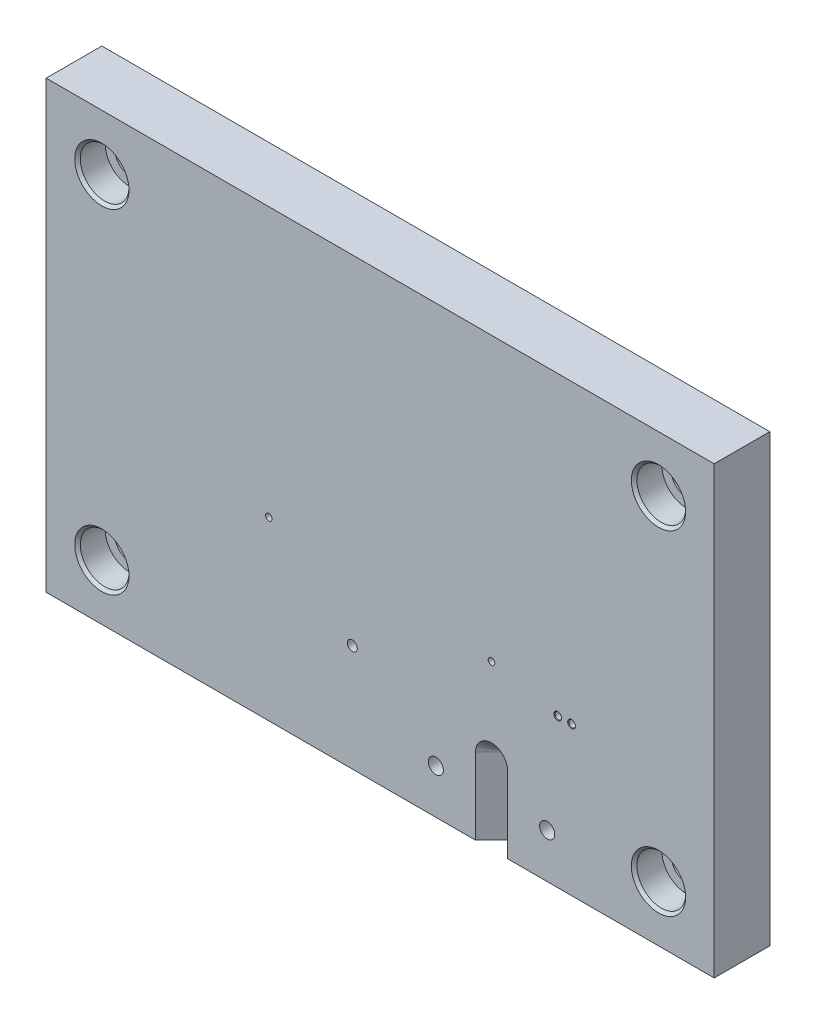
ISO-10303-21;
HEADER;
FILE_DESCRIPTION(('STEP AP214'),'2;1');
FILE_NAME('part.step','',(''),(''),'','','');
FILE_SCHEMA(('AUTOMOTIVE_DESIGN { 1 0 10303 214 1 1 1 1 }'));
ENDSEC;
DATA;
#1=APPLICATION_CONTEXT('core data for automotive mechanical design processes');
#2=APPLICATION_PROTOCOL_DEFINITION('international standard','automotive_design',2000,#1);
#3=PRODUCT_CONTEXT('',#1,'mechanical');
#4=PRODUCT('Part','Part','',(#3));
#5=PRODUCT_RELATED_PRODUCT_CATEGORY('part','',(#4));
#6=PRODUCT_DEFINITION_FORMATION('','',#4);
#7=PRODUCT_DEFINITION_CONTEXT('part definition',#1,'design');
#8=PRODUCT_DEFINITION('design','',#6,#7);
#9=PRODUCT_DEFINITION_SHAPE('','',#8);
#10=(LENGTH_UNIT() NAMED_UNIT(*) SI_UNIT(.MILLI.,.METRE.));
#11=(NAMED_UNIT(*) PLANE_ANGLE_UNIT() SI_UNIT($,.RADIAN.));
#12=(NAMED_UNIT(*) SI_UNIT($,.STERADIAN.) SOLID_ANGLE_UNIT());
#13=UNCERTAINTY_MEASURE_WITH_UNIT(LENGTH_MEASURE(1.E-05),#10,'distance_accuracy_value','');
#14=(GEOMETRIC_REPRESENTATION_CONTEXT(3) GLOBAL_UNCERTAINTY_ASSIGNED_CONTEXT((#13)) GLOBAL_UNIT_ASSIGNED_CONTEXT((#10,
#11,#12)) REPRESENTATION_CONTEXT('',''));
#15=CARTESIAN_POINT('',(0.,0.,0.));
#16=DIRECTION('',(0.,0.,1.));
#17=DIRECTION('',(1.,0.,0.));
#18=AXIS2_PLACEMENT_3D('',#15,#16,#17);
#19=CARTESIAN_POINT('',(152.4,101.6,12.7));
#20=DIRECTION('',(-1.,0.,0.));
#21=DIRECTION('',(0.,-1.,0.));
#22=AXIS2_PLACEMENT_3D('',#19,#20,#21);
#23=PLANE('',#22);
#24=DIRECTION('',(0.,1.,0.));
#25=VECTOR('',#24,1.);
#26=CARTESIAN_POINT('',(152.4,101.6,0.));
#27=LINE('',#26,#25);
#28=CARTESIAN_POINT('',(152.4,0.,0.));
#29=VERTEX_POINT('',#28);
#30=CARTESIAN_POINT('',(152.4,101.6,0.));
#31=VERTEX_POINT('',#30);
#32=EDGE_CURVE('E220',#29,#31,#27,.T.);
#33=ORIENTED_EDGE('',*,*,#32,.T.);
#34=DIRECTION('',(0.,0.,-1.));
#35=VECTOR('',#34,1.);
#36=CARTESIAN_POINT('',(152.4,101.6,12.7));
#37=LINE('',#36,#35);
#38=CARTESIAN_POINT('',(152.4,101.6,12.7));
#39=VERTEX_POINT('',#38);
#40=EDGE_CURVE('E249',#39,#31,#37,.T.);
#41=ORIENTED_EDGE('',*,*,#40,.F.);
#42=DIRECTION('',(0.,1.,0.));
#43=VECTOR('',#42,1.);
#44=CARTESIAN_POINT('',(152.4,101.6,12.7));
#45=LINE('',#44,#43);
#46=CARTESIAN_POINT('',(152.4,0.,12.7));
#47=VERTEX_POINT('',#46);
#48=EDGE_CURVE('E221',#47,#39,#45,.T.);
#49=ORIENTED_EDGE('',*,*,#48,.F.);
#50=DIRECTION('',(0.,0.,-1.));
#51=VECTOR('',#50,1.);
#52=CARTESIAN_POINT('',(152.4,0.,12.7));
#53=LINE('',#52,#51);
#54=EDGE_CURVE('E233',#47,#29,#53,.T.);
#55=ORIENTED_EDGE('',*,*,#54,.T.);
#56=EDGE_LOOP('',(#33,#41,#49,#55));
#57=FACE_BOUND('',#56,.T.);
#58=ADVANCED_FACE('F31',(#57),#23,.F.);
#59=CARTESIAN_POINT('',(0.,101.6,12.7));
#60=DIRECTION('',(0.,-1.,0.));
#61=DIRECTION('',(0.,0.,-1.));
#62=AXIS2_PLACEMENT_3D('',#59,#60,#61);
#63=PLANE('',#62);
#64=DIRECTION('',(-1.,0.,0.));
#65=VECTOR('',#64,1.);
#66=CARTESIAN_POINT('',(0.,101.6,0.));
#67=LINE('',#66,#65);
#68=CARTESIAN_POINT('',(0.,101.6,0.));
#69=VERTEX_POINT('',#68);
#70=EDGE_CURVE('E236',#31,#69,#67,.T.);
#71=ORIENTED_EDGE('',*,*,#70,.T.);
#72=DIRECTION('',(0.,0.,-1.));
#73=VECTOR('',#72,1.);
#74=CARTESIAN_POINT('',(0.,101.6,12.7));
#75=LINE('',#74,#73);
#76=CARTESIAN_POINT('',(0.,101.6,12.7));
#77=VERTEX_POINT('',#76);
#78=EDGE_CURVE('E246',#77,#69,#75,.T.);
#79=ORIENTED_EDGE('',*,*,#78,.F.);
#80=DIRECTION('',(-1.,0.,0.));
#81=VECTOR('',#80,1.);
#82=CARTESIAN_POINT('',(0.,101.6,12.7));
#83=LINE('',#82,#81);
#84=EDGE_CURVE('E224',#39,#77,#83,.T.);
#85=ORIENTED_EDGE('',*,*,#84,.F.);
#86=ORIENTED_EDGE('',*,*,#40,.T.);
#87=EDGE_LOOP('',(#71,#79,#85,#86));
#88=FACE_BOUND('',#87,.T.);
#89=ADVANCED_FACE('F283',(#88),#63,.F.);
#90=CARTESIAN_POINT('',(0.,101.6,12.7));
#91=DIRECTION('',(1.,0.,0.));
#92=DIRECTION('',(0.,1.,0.));
#93=AXIS2_PLACEMENT_3D('',#90,#91,#92);
#94=PLANE('',#93);
#95=DIRECTION('',(0.,-1.,0.));
#96=VECTOR('',#95,1.);
#97=CARTESIAN_POINT('',(0.,101.6,0.));
#98=LINE('',#97,#96);
#99=CARTESIAN_POINT('',(0.,0.,0.));
#100=VERTEX_POINT('',#99);
#101=EDGE_CURVE('E238',#69,#100,#98,.T.);
#102=ORIENTED_EDGE('',*,*,#101,.T.);
#103=DIRECTION('',(0.,0.,-1.));
#104=VECTOR('',#103,1.);
#105=CARTESIAN_POINT('',(0.,0.,12.7));
#106=LINE('',#105,#104);
#107=CARTESIAN_POINT('',(0.,0.,12.7));
#108=VERTEX_POINT('',#107);
#109=EDGE_CURVE('E243',#108,#100,#106,.T.);
#110=ORIENTED_EDGE('',*,*,#109,.F.);
#111=DIRECTION('',(0.,-1.,0.));
#112=VECTOR('',#111,1.);
#113=CARTESIAN_POINT('',(0.,101.6,12.7));
#114=LINE('',#113,#112);
#115=EDGE_CURVE('E227',#77,#108,#114,.T.);
#116=ORIENTED_EDGE('',*,*,#115,.F.);
#117=ORIENTED_EDGE('',*,*,#78,.T.);
#118=EDGE_LOOP('',(#102,#110,#116,#117));
#119=FACE_BOUND('',#118,.T.);
#120=ADVANCED_FACE('F289',(#119),#94,.F.);
#121=CARTESIAN_POINT('',(0.,0.,12.7));
#122=DIRECTION('',(0.,1.,0.));
#123=DIRECTION('',(0.,0.,1.));
#124=AXIS2_PLACEMENT_3D('',#121,#122,#123);
#125=PLANE('',#124);
#126=DIRECTION('',(1.,0.,0.));
#127=VECTOR('',#126,1.);
#128=CARTESIAN_POINT('',(0.,0.,12.7));
#129=LINE('',#128,#127);
#130=CARTESIAN_POINT('',(105.26268,0.,12.7));
#131=VERTEX_POINT('',#130);
#132=EDGE_CURVE('E229',#131,#47,#129,.T.);
#133=ORIENTED_EDGE('',*,*,#132,.F.);
#134=DIRECTION('',(0.707106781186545,0.,0.70710678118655));
#135=VECTOR('',#134,1.);
#136=CARTESIAN_POINT('',(101.6,0.,9.03732));
#137=LINE('',#136,#135);
#138=CARTESIAN_POINT('',(101.6,0.,9.03732));
#139=VERTEX_POINT('',#138);
#140=EDGE_CURVE('E126',#139,#131,#137,.T.);
#141=ORIENTED_EDGE('',*,*,#140,.F.);
#142=DIRECTION('',(0.707106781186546,0.,-0.707106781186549));
#143=VECTOR('',#142,1.);
#144=CARTESIAN_POINT('',(97.93732,0.,12.7));
#145=LINE('',#144,#143);
#146=CARTESIAN_POINT('',(97.93732,0.,12.7));
#147=VERTEX_POINT('',#146);
#148=EDGE_CURVE('E133',#147,#139,#145,.T.);
#149=ORIENTED_EDGE('',*,*,#148,.F.);
#150=EDGE_CURVE('E230',#108,#147,#129,.T.);
#151=ORIENTED_EDGE('',*,*,#150,.F.);
#152=ORIENTED_EDGE('',*,*,#109,.T.);
#153=DIRECTION('',(1.,0.,0.));
#154=VECTOR('',#153,1.);
#155=CARTESIAN_POINT('',(0.,0.,0.));
#156=LINE('',#155,#154);
#157=EDGE_CURVE('E225',#100,#29,#156,.T.);
#158=ORIENTED_EDGE('',*,*,#157,.T.);
#159=ORIENTED_EDGE('',*,*,#54,.F.);
#160=EDGE_LOOP('',(#133,#141,#149,#151,#152,#158,#159));
#161=FACE_BOUND('',#160,.T.);
#162=ADVANCED_FACE('F295',(#161),#125,.F.);
#163=CARTESIAN_POINT('',(152.4,0.,12.7));
#164=DIRECTION('',(0.,0.,1.));
#165=DIRECTION('',(1.,0.,0.));
#166=AXIS2_PLACEMENT_3D('',#163,#164,#165);
#167=PLANE('',#166);
#168=CARTESIAN_POINT('',(101.6,17.399,12.7));
#169=DIRECTION('',(0.,0.,1.));
#170=DIRECTION('',(1.,0.,0.));
#171=AXIS2_PLACEMENT_3D('',#168,#169,#170);
#172=CIRCLE('',#171,3.65760000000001);
#173=CARTESIAN_POINT('',(105.2576,17.399,12.7));
#174=VERTEX_POINT('',#173);
#175=CARTESIAN_POINT('',(97.9424,17.399,12.7));
#176=VERTEX_POINT('',#175);
#177=EDGE_CURVE('E45',#174,#176,#172,.T.);
#178=ORIENTED_EDGE('',*,*,#177,.F.);
#179=DIRECTION('',(-1.,0.,0.));
#180=VECTOR('',#179,1.);
#181=CARTESIAN_POINT('',(97.93732,17.399,12.7));
#182=LINE('',#181,#180);
#183=CARTESIAN_POINT('',(105.26268,17.399,12.7));
#184=VERTEX_POINT('',#183);
#185=EDGE_CURVE('E119',#184,#174,#182,.T.);
#186=ORIENTED_EDGE('',*,*,#185,.F.);
#187=DIRECTION('',(0.,-1.,0.));
#188=VECTOR('',#187,1.);
#189=CARTESIAN_POINT('',(105.26268,17.399,12.7));
#190=LINE('',#189,#188);
#191=EDGE_CURVE('E137',#184,#131,#190,.T.);
#192=ORIENTED_EDGE('',*,*,#191,.T.);
#193=ORIENTED_EDGE('',*,*,#132,.T.);
#194=ORIENTED_EDGE('',*,*,#48,.T.);
#195=ORIENTED_EDGE('',*,*,#84,.T.);
#196=ORIENTED_EDGE('',*,*,#115,.T.);
#197=ORIENTED_EDGE('',*,*,#150,.T.);
#198=DIRECTION('',(0.,-1.,0.));
#199=VECTOR('',#198,1.);
#200=CARTESIAN_POINT('',(97.93732,17.399,12.7));
#201=LINE('',#200,#199);
#202=CARTESIAN_POINT('',(97.93732,17.399,12.7));
#203=VERTEX_POINT('',#202);
#204=EDGE_CURVE('E132',#203,#147,#201,.T.);
#205=ORIENTED_EDGE('',*,*,#204,.F.);
#206=EDGE_CURVE('E123',#176,#203,#182,.T.);
#207=ORIENTED_EDGE('',*,*,#206,.F.);
#208=EDGE_LOOP('',(#178,#186,#192,#193,#194,#195,#196,#197,#205,#207));
#209=FACE_BOUND('',#208,.T.);
#210=CARTESIAN_POINT('',(69.85,24.384,12.7));
#211=DIRECTION('',(0.,0.,1.));
#212=DIRECTION('',(1.,0.,0.));
#213=AXIS2_PLACEMENT_3D('',#210,#211,#212);
#214=CIRCLE('',#213,1.13029999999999);
#215=CARTESIAN_POINT('',(70.9803,24.384,12.7));
#216=VERTEX_POINT('',#215);
#217=EDGE_CURVE('E115',#216,#216,#214,.T.);
#218=ORIENTED_EDGE('',*,*,#217,.F.);
#219=EDGE_LOOP('',(#218));
#220=FACE_BOUND('',#219,.T.);
#221=CARTESIAN_POINT('',(119.86895,33.909,12.7));
#222=DIRECTION('',(0.,0.,1.));
#223=DIRECTION('',(1.,0.,0.));
#224=AXIS2_PLACEMENT_3D('',#221,#222,#223);
#225=CIRCLE('',#224,0.882649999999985);
#226=CARTESIAN_POINT('',(120.7516,33.909,12.7));
#227=VERTEX_POINT('',#226);
#228=EDGE_CURVE('E258',#227,#227,#225,.F.);
#229=ORIENTED_EDGE('',*,*,#228,.T.);
#230=EDGE_LOOP('',(#229));
#231=FACE_BOUND('',#230,.T.);
#232=CARTESIAN_POINT('',(116.69395,33.909,12.7));
#233=DIRECTION('',(0.,0.,1.));
#234=DIRECTION('',(1.,0.,0.));
#235=AXIS2_PLACEMENT_3D('',#232,#233,#234);
#236=CIRCLE('',#235,0.882649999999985);
#237=CARTESIAN_POINT('',(117.5766,33.909,12.7));
#238=VERTEX_POINT('',#237);
#239=EDGE_CURVE('E255',#238,#238,#236,.F.);
#240=ORIENTED_EDGE('',*,*,#239,.T.);
#241=EDGE_LOOP('',(#240));
#242=FACE_BOUND('',#241,.T.);
#243=CARTESIAN_POINT('',(114.3,10.16,12.7));
#244=DIRECTION('',(0.,0.,1.));
#245=DIRECTION('',(1.,0.,0.));
#246=AXIS2_PLACEMENT_3D('',#243,#244,#245);
#247=CIRCLE('',#246,1.72719999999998);
#248=CARTESIAN_POINT('',(116.0272,10.16,12.7));
#249=VERTEX_POINT('',#248);
#250=EDGE_CURVE('E643',#249,#249,#247,.T.);
#251=ORIENTED_EDGE('',*,*,#250,.F.);
#252=EDGE_LOOP('',(#251));
#253=FACE_BOUND('',#252,.T.);
#254=CARTESIAN_POINT('',(88.9,10.16,12.7));
#255=DIRECTION('',(0.,0.,1.));
#256=DIRECTION('',(1.,0.,0.));
#257=AXIS2_PLACEMENT_3D('',#254,#255,#256);
#258=CIRCLE('',#257,1.72719999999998);
#259=CARTESIAN_POINT('',(90.6271999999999,10.16,12.7));
#260=VERTEX_POINT('',#259);
#261=EDGE_CURVE('E647',#260,#260,#258,.T.);
#262=ORIENTED_EDGE('',*,*,#261,.F.);
#263=EDGE_LOOP('',(#262));
#264=FACE_BOUND('',#263,.T.);
#265=CARTESIAN_POINT('',(101.6,37.1348,12.7));
#266=DIRECTION('',(0.,0.,1.));
#267=DIRECTION('',(1.,0.,0.));
#268=AXIS2_PLACEMENT_3D('',#265,#266,#267);
#269=CIRCLE('',#268,0.755649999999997);
#270=CARTESIAN_POINT('',(102.35565,37.1348,12.7));
#271=VERTEX_POINT('',#270);
#272=EDGE_CURVE('E148',#271,#271,#269,.T.);
#273=ORIENTED_EDGE('',*,*,#272,.F.);
#274=EDGE_LOOP('',(#273));
#275=FACE_BOUND('',#274,.T.);
#276=CARTESIAN_POINT('',(50.8,40.259,12.7));
#277=DIRECTION('',(0.,0.,1.));
#278=DIRECTION('',(1.,0.,0.));
#279=AXIS2_PLACEMENT_3D('',#276,#277,#278);
#280=CIRCLE('',#279,0.755649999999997);
#281=CARTESIAN_POINT('',(51.55565,40.259,12.7));
#282=VERTEX_POINT('',#281);
#283=EDGE_CURVE('E154',#282,#282,#280,.T.);
#284=ORIENTED_EDGE('',*,*,#283,.F.);
#285=EDGE_LOOP('',(#284));
#286=FACE_BOUND('',#285,.T.);
#287=CARTESIAN_POINT('',(139.7,12.7,12.7));
#288=DIRECTION('',(0.,0.,1.));
#289=DIRECTION('',(1.,0.,0.));
#290=AXIS2_PLACEMENT_3D('',#287,#288,#289);
#291=CIRCLE('',#290,6.19125000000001);
#292=CARTESIAN_POINT('',(145.89125,12.7,12.7));
#293=VERTEX_POINT('',#292);
#294=EDGE_CURVE('E160',#293,#293,#291,.T.);
#295=ORIENTED_EDGE('',*,*,#294,.F.);
#296=EDGE_LOOP('',(#295));
#297=FACE_BOUND('',#296,.T.);
#298=CARTESIAN_POINT('',(139.7,88.9,12.7));
#299=DIRECTION('',(0.,0.,1.));
#300=DIRECTION('',(1.,0.,0.));
#301=AXIS2_PLACEMENT_3D('',#298,#299,#300);
#302=CIRCLE('',#301,6.19125000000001);
#303=CARTESIAN_POINT('',(145.89125,88.9,12.7));
#304=VERTEX_POINT('',#303);
#305=EDGE_CURVE('E175',#304,#304,#302,.T.);
#306=ORIENTED_EDGE('',*,*,#305,.F.);
#307=EDGE_LOOP('',(#306));
#308=FACE_BOUND('',#307,.T.);
#309=CARTESIAN_POINT('',(12.7,88.9,12.7));
#310=DIRECTION('',(0.,0.,1.));
#311=DIRECTION('',(1.,0.,0.));
#312=AXIS2_PLACEMENT_3D('',#309,#310,#311);
#313=CIRCLE('',#312,6.19125);
#314=CARTESIAN_POINT('',(18.89125,88.9,12.7));
#315=VERTEX_POINT('',#314);
#316=EDGE_CURVE('E190',#315,#315,#313,.T.);
#317=ORIENTED_EDGE('',*,*,#316,.F.);
#318=EDGE_LOOP('',(#317));
#319=FACE_BOUND('',#318,.T.);
#320=CARTESIAN_POINT('',(12.7,12.7,12.7));
#321=DIRECTION('',(0.,0.,1.));
#322=DIRECTION('',(1.,0.,0.));
#323=AXIS2_PLACEMENT_3D('',#320,#321,#322);
#324=CIRCLE('',#323,6.19125);
#325=CARTESIAN_POINT('',(18.89125,12.7,12.7));
#326=VERTEX_POINT('',#325);
#327=EDGE_CURVE('E205',#326,#326,#324,.T.);
#328=ORIENTED_EDGE('',*,*,#327,.F.);
#329=EDGE_LOOP('',(#328));
#330=FACE_BOUND('',#329,.T.);
#331=ADVANCED_FACE('F299',(#209,#220,#231,#242,#253,#264,#275,#286,#297,#308,#319,#330),#167,.T.);
#332=CARTESIAN_POINT('',(152.4,0.,0.));
#333=DIRECTION('',(0.,0.,1.));
#334=DIRECTION('',(1.,0.,0.));
#335=AXIS2_PLACEMENT_3D('',#332,#333,#334);
#336=PLANE('',#335);
#337=CARTESIAN_POINT('',(69.85,24.384,0.));
#338=DIRECTION('',(0.,0.,1.));
#339=DIRECTION('',(1.,0.,0.));
#340=AXIS2_PLACEMENT_3D('',#337,#338,#339);
#341=CIRCLE('',#340,1.1303);
#342=CARTESIAN_POINT('',(70.9803,24.384,0.));
#343=VERTEX_POINT('',#342);
#344=EDGE_CURVE('E645',#343,#343,#341,.T.);
#345=ORIENTED_EDGE('',*,*,#344,.T.);
#346=EDGE_LOOP('',(#345));
#347=FACE_BOUND('',#346,.T.);
#348=CARTESIAN_POINT('',(114.3,10.16,0.));
#349=DIRECTION('',(0.,0.,1.));
#350=DIRECTION('',(1.,0.,0.));
#351=AXIS2_PLACEMENT_3D('',#348,#349,#350);
#352=CIRCLE('',#351,1.7272);
#353=CARTESIAN_POINT('',(116.0272,10.16,0.));
#354=VERTEX_POINT('',#353);
#355=EDGE_CURVE('E640',#354,#354,#352,.T.);
#356=ORIENTED_EDGE('',*,*,#355,.T.);
#357=EDGE_LOOP('',(#356));
#358=FACE_BOUND('',#357,.T.);
#359=CARTESIAN_POINT('',(88.9,10.16,0.));
#360=DIRECTION('',(0.,0.,1.));
#361=DIRECTION('',(1.,0.,0.));
#362=AXIS2_PLACEMENT_3D('',#359,#360,#361);
#363=CIRCLE('',#362,1.7272);
#364=CARTESIAN_POINT('',(90.6272,10.16,0.));
#365=VERTEX_POINT('',#364);
#366=EDGE_CURVE('E128',#365,#365,#363,.T.);
#367=ORIENTED_EDGE('',*,*,#366,.T.);
#368=EDGE_LOOP('',(#367));
#369=FACE_BOUND('',#368,.T.);
#370=CARTESIAN_POINT('',(116.69395,33.909,0.));
#371=DIRECTION('',(0.,0.,1.));
#372=DIRECTION('',(1.,0.,0.));
#373=AXIS2_PLACEMENT_3D('',#370,#371,#372);
#374=CIRCLE('',#373,0.755649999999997);
#375=CARTESIAN_POINT('',(117.4496,33.909,0.));
#376=VERTEX_POINT('',#375);
#377=EDGE_CURVE('E139',#376,#376,#374,.T.);
#378=ORIENTED_EDGE('',*,*,#377,.T.);
#379=EDGE_LOOP('',(#378));
#380=FACE_BOUND('',#379,.T.);
#381=CARTESIAN_POINT('',(119.86895,33.909,0.));
#382=DIRECTION('',(0.,0.,1.));
#383=DIRECTION('',(1.,0.,0.));
#384=AXIS2_PLACEMENT_3D('',#381,#382,#383);
#385=CIRCLE('',#384,0.755649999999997);
#386=CARTESIAN_POINT('',(120.6246,33.909,0.));
#387=VERTEX_POINT('',#386);
#388=EDGE_CURVE('E145',#387,#387,#385,.T.);
#389=ORIENTED_EDGE('',*,*,#388,.T.);
#390=EDGE_LOOP('',(#389));
#391=FACE_BOUND('',#390,.T.);
#392=CARTESIAN_POINT('',(139.7,12.7,0.));
#393=DIRECTION('',(0.,0.,1.));
#394=DIRECTION('',(1.,0.,0.));
#395=AXIS2_PLACEMENT_3D('',#392,#393,#394);
#396=CIRCLE('',#395,3.3782);
#397=CARTESIAN_POINT('',(143.0782,12.7,0.));
#398=VERTEX_POINT('',#397);
#399=EDGE_CURVE('E172',#398,#398,#396,.T.);
#400=ORIENTED_EDGE('',*,*,#399,.T.);
#401=EDGE_LOOP('',(#400));
#402=FACE_BOUND('',#401,.T.);
#403=CARTESIAN_POINT('',(139.7,88.9,0.));
#404=DIRECTION('',(0.,0.,1.));
#405=DIRECTION('',(1.,0.,0.));
#406=AXIS2_PLACEMENT_3D('',#403,#404,#405);
#407=CIRCLE('',#406,3.3782);
#408=CARTESIAN_POINT('',(143.0782,88.9,0.));
#409=VERTEX_POINT('',#408);
#410=EDGE_CURVE('E187',#409,#409,#407,.T.);
#411=ORIENTED_EDGE('',*,*,#410,.T.);
#412=EDGE_LOOP('',(#411));
#413=FACE_BOUND('',#412,.T.);
#414=CARTESIAN_POINT('',(12.7,88.9,0.));
#415=DIRECTION('',(0.,0.,1.));
#416=DIRECTION('',(1.,0.,0.));
#417=AXIS2_PLACEMENT_3D('',#414,#415,#416);
#418=CIRCLE('',#417,3.3782);
#419=CARTESIAN_POINT('',(16.0782,88.9,0.));
#420=VERTEX_POINT('',#419);
#421=EDGE_CURVE('E202',#420,#420,#418,.T.);
#422=ORIENTED_EDGE('',*,*,#421,.T.);
#423=EDGE_LOOP('',(#422));
#424=FACE_BOUND('',#423,.T.);
#425=CARTESIAN_POINT('',(12.7,12.7,0.));
#426=DIRECTION('',(0.,0.,1.));
#427=DIRECTION('',(1.,0.,0.));
#428=AXIS2_PLACEMENT_3D('',#425,#426,#427);
#429=CIRCLE('',#428,3.3782);
#430=CARTESIAN_POINT('',(16.0782,12.7,0.));
#431=VERTEX_POINT('',#430);
#432=EDGE_CURVE('E217',#431,#431,#429,.T.);
#433=ORIENTED_EDGE('',*,*,#432,.T.);
#434=EDGE_LOOP('',(#433));
#435=FACE_BOUND('',#434,.T.);
#436=ORIENTED_EDGE('',*,*,#32,.F.);
#437=ORIENTED_EDGE('',*,*,#157,.F.);
#438=ORIENTED_EDGE('',*,*,#101,.F.);
#439=ORIENTED_EDGE('',*,*,#70,.F.);
#440=EDGE_LOOP('',(#436,#437,#438,#439));
#441=FACE_BOUND('',#440,.T.);
#442=ADVANCED_FACE('F301',(#347,#358,#369,#380,#391,#402,#413,#424,#435,#441),#336,.F.);
#443=CARTESIAN_POINT('',(12.7,12.7,12.7));
#444=DIRECTION('',(0.,0.,1.));
#445=DIRECTION('',(1.,0.,0.));
#446=AXIS2_PLACEMENT_3D('',#443,#444,#445);
#447=CYLINDRICAL_SURFACE('',#446,3.3782);
#448=ORIENTED_EDGE('',*,*,#432,.F.);
#449=EDGE_LOOP('',(#448));
#450=FACE_BOUND('',#449,.T.);
#451=CARTESIAN_POINT('',(12.7,12.7,6.35));
#452=DIRECTION('',(0.,0.,1.));
#453=DIRECTION('',(1.,0.,0.));
#454=AXIS2_PLACEMENT_3D('',#451,#452,#453);
#455=CIRCLE('',#454,3.3782);
#456=CARTESIAN_POINT('',(16.0782,12.7,6.35));
#457=VERTEX_POINT('',#456);
#458=EDGE_CURVE('E214',#457,#457,#455,.T.);
#459=ORIENTED_EDGE('',*,*,#458,.T.);
#460=EDGE_LOOP('',(#459));
#461=FACE_BOUND('',#460,.T.);
#462=ADVANCED_FACE('F304',(#450,#461),#447,.F.);
#463=CARTESIAN_POINT('',(18.25625,12.7,6.35));
#464=DIRECTION('',(0.,0.,-1.));
#465=DIRECTION('',(-1.,0.,0.));
#466=AXIS2_PLACEMENT_3D('',#463,#464,#465);
#467=PLANE('',#466);
#468=ORIENTED_EDGE('',*,*,#458,.F.);
#469=EDGE_LOOP('',(#468));
#470=FACE_BOUND('',#469,.T.);
#471=CARTESIAN_POINT('',(12.7,12.7,6.35));
#472=DIRECTION('',(0.,0.,1.));
#473=DIRECTION('',(1.,0.,0.));
#474=AXIS2_PLACEMENT_3D('',#471,#472,#473);
#475=CIRCLE('',#474,5.55625);
#476=CARTESIAN_POINT('',(18.25625,12.7,6.35));
#477=VERTEX_POINT('',#476);
#478=EDGE_CURVE('E211',#477,#477,#475,.T.);
#479=ORIENTED_EDGE('',*,*,#478,.T.);
#480=EDGE_LOOP('',(#479));
#481=FACE_BOUND('',#480,.T.);
#482=ADVANCED_FACE('F310',(#470,#481),#467,.F.);
#483=CARTESIAN_POINT('',(12.7,12.7,12.7));
#484=DIRECTION('',(0.,0.,1.));
#485=DIRECTION('',(1.,0.,0.));
#486=AXIS2_PLACEMENT_3D('',#483,#484,#485);
#487=CYLINDRICAL_SURFACE('',#486,5.55625);
#488=ORIENTED_EDGE('',*,*,#478,.F.);
#489=EDGE_LOOP('',(#488));
#490=FACE_BOUND('',#489,.T.);
#491=CARTESIAN_POINT('',(12.7,12.7,12.065));
#492=DIRECTION('',(0.,0.,1.));
#493=DIRECTION('',(1.,0.,0.));
#494=AXIS2_PLACEMENT_3D('',#491,#492,#493);
#495=CIRCLE('',#494,5.55625);
#496=CARTESIAN_POINT('',(18.25625,12.7,12.065));
#497=VERTEX_POINT('',#496);
#498=EDGE_CURVE('E208',#497,#497,#495,.T.);
#499=ORIENTED_EDGE('',*,*,#498,.T.);
#500=EDGE_LOOP('',(#499));
#501=FACE_BOUND('',#500,.T.);
#502=ADVANCED_FACE('F314',(#490,#501),#487,.F.);
#503=CARTESIAN_POINT('',(12.7,12.7,12.7));
#504=DIRECTION('',(0.,0.,1.));
#505=DIRECTION('',(1.,0.,0.));
#506=AXIS2_PLACEMENT_3D('',#503,#504,#505);
#507=CONICAL_SURFACE('',#506,6.19125,0.785398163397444);
#508=ORIENTED_EDGE('',*,*,#498,.F.);
#509=EDGE_LOOP('',(#508));
#510=FACE_BOUND('',#509,.T.);
#511=ORIENTED_EDGE('',*,*,#327,.T.);
#512=EDGE_LOOP('',(#511));
#513=FACE_BOUND('',#512,.T.);
#514=ADVANCED_FACE('F318',(#510,#513),#507,.F.);
#515=CARTESIAN_POINT('',(12.7,88.9,12.7));
#516=DIRECTION('',(0.,0.,1.));
#517=DIRECTION('',(1.,0.,0.));
#518=AXIS2_PLACEMENT_3D('',#515,#516,#517);
#519=CYLINDRICAL_SURFACE('',#518,3.3782);
#520=ORIENTED_EDGE('',*,*,#421,.F.);
#521=EDGE_LOOP('',(#520));
#522=FACE_BOUND('',#521,.T.);
#523=CARTESIAN_POINT('',(12.7,88.9,6.35));
#524=DIRECTION('',(0.,0.,1.));
#525=DIRECTION('',(1.,0.,0.));
#526=AXIS2_PLACEMENT_3D('',#523,#524,#525);
#527=CIRCLE('',#526,3.3782);
#528=CARTESIAN_POINT('',(16.0782,88.9,6.35));
#529=VERTEX_POINT('',#528);
#530=EDGE_CURVE('E199',#529,#529,#527,.T.);
#531=ORIENTED_EDGE('',*,*,#530,.T.);
#532=EDGE_LOOP('',(#531));
#533=FACE_BOUND('',#532,.T.);
#534=ADVANCED_FACE('F322',(#522,#533),#519,.F.);
#535=CARTESIAN_POINT('',(18.25625,88.9,6.35));
#536=DIRECTION('',(0.,0.,-1.));
#537=DIRECTION('',(-1.,0.,0.));
#538=AXIS2_PLACEMENT_3D('',#535,#536,#537);
#539=PLANE('',#538);
#540=ORIENTED_EDGE('',*,*,#530,.F.);
#541=EDGE_LOOP('',(#540));
#542=FACE_BOUND('',#541,.T.);
#543=CARTESIAN_POINT('',(12.7,88.9,6.35));
#544=DIRECTION('',(0.,0.,1.));
#545=DIRECTION('',(1.,0.,0.));
#546=AXIS2_PLACEMENT_3D('',#543,#544,#545);
#547=CIRCLE('',#546,5.55625);
#548=CARTESIAN_POINT('',(18.25625,88.9,6.35));
#549=VERTEX_POINT('',#548);
#550=EDGE_CURVE('E196',#549,#549,#547,.T.);
#551=ORIENTED_EDGE('',*,*,#550,.T.);
#552=EDGE_LOOP('',(#551));
#553=FACE_BOUND('',#552,.T.);
#554=ADVANCED_FACE('F326',(#542,#553),#539,.F.);
#555=CARTESIAN_POINT('',(12.7,88.9,12.7));
#556=DIRECTION('',(0.,0.,1.));
#557=DIRECTION('',(1.,0.,0.));
#558=AXIS2_PLACEMENT_3D('',#555,#556,#557);
#559=CYLINDRICAL_SURFACE('',#558,5.55625);
#560=ORIENTED_EDGE('',*,*,#550,.F.);
#561=EDGE_LOOP('',(#560));
#562=FACE_BOUND('',#561,.T.);
#563=CARTESIAN_POINT('',(12.7,88.9,12.065));
#564=DIRECTION('',(0.,0.,1.));
#565=DIRECTION('',(1.,0.,0.));
#566=AXIS2_PLACEMENT_3D('',#563,#564,#565);
#567=CIRCLE('',#566,5.55625);
#568=CARTESIAN_POINT('',(18.25625,88.9,12.065));
#569=VERTEX_POINT('',#568);
#570=EDGE_CURVE('E193',#569,#569,#567,.T.);
#571=ORIENTED_EDGE('',*,*,#570,.T.);
#572=EDGE_LOOP('',(#571));
#573=FACE_BOUND('',#572,.T.);
#574=ADVANCED_FACE('F330',(#562,#573),#559,.F.);
#575=CARTESIAN_POINT('',(12.7,88.9,12.7));
#576=DIRECTION('',(0.,0.,1.));
#577=DIRECTION('',(1.,0.,0.));
#578=AXIS2_PLACEMENT_3D('',#575,#576,#577);
#579=CONICAL_SURFACE('',#578,6.19125,0.785398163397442);
#580=ORIENTED_EDGE('',*,*,#570,.F.);
#581=EDGE_LOOP('',(#580));
#582=FACE_BOUND('',#581,.T.);
#583=ORIENTED_EDGE('',*,*,#316,.T.);
#584=EDGE_LOOP('',(#583));
#585=FACE_BOUND('',#584,.T.);
#586=ADVANCED_FACE('F334',(#582,#585),#579,.F.);
#587=CARTESIAN_POINT('',(139.7,88.9,12.7));
#588=DIRECTION('',(0.,0.,1.));
#589=DIRECTION('',(1.,0.,0.));
#590=AXIS2_PLACEMENT_3D('',#587,#588,#589);
#591=CYLINDRICAL_SURFACE('',#590,3.3782);
#592=ORIENTED_EDGE('',*,*,#410,.F.);
#593=EDGE_LOOP('',(#592));
#594=FACE_BOUND('',#593,.T.);
#595=CARTESIAN_POINT('',(139.7,88.9,6.35));
#596=DIRECTION('',(0.,0.,1.));
#597=DIRECTION('',(1.,0.,0.));
#598=AXIS2_PLACEMENT_3D('',#595,#596,#597);
#599=CIRCLE('',#598,3.3782);
#600=CARTESIAN_POINT('',(143.0782,88.9,6.35));
#601=VERTEX_POINT('',#600);
#602=EDGE_CURVE('E184',#601,#601,#599,.T.);
#603=ORIENTED_EDGE('',*,*,#602,.T.);
#604=EDGE_LOOP('',(#603));
#605=FACE_BOUND('',#604,.T.);
#606=ADVANCED_FACE('F338',(#594,#605),#591,.F.);
#607=CARTESIAN_POINT('',(145.25625,88.9,6.35));
#608=DIRECTION('',(0.,0.,-1.));
#609=DIRECTION('',(-1.,0.,0.));
#610=AXIS2_PLACEMENT_3D('',#607,#608,#609);
#611=PLANE('',#610);
#612=ORIENTED_EDGE('',*,*,#602,.F.);
#613=EDGE_LOOP('',(#612));
#614=FACE_BOUND('',#613,.T.);
#615=CARTESIAN_POINT('',(139.7,88.9,6.35));
#616=DIRECTION('',(0.,0.,1.));
#617=DIRECTION('',(1.,0.,0.));
#618=AXIS2_PLACEMENT_3D('',#615,#616,#617);
#619=CIRCLE('',#618,5.55624999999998);
#620=CARTESIAN_POINT('',(145.25625,88.9,6.35));
#621=VERTEX_POINT('',#620);
#622=EDGE_CURVE('E181',#621,#621,#619,.T.);
#623=ORIENTED_EDGE('',*,*,#622,.T.);
#624=EDGE_LOOP('',(#623));
#625=FACE_BOUND('',#624,.T.);
#626=ADVANCED_FACE('F342',(#614,#625),#611,.F.);
#627=CARTESIAN_POINT('',(139.7,88.9,12.7));
#628=DIRECTION('',(0.,0.,1.));
#629=DIRECTION('',(1.,0.,0.));
#630=AXIS2_PLACEMENT_3D('',#627,#628,#629);
#631=CYLINDRICAL_SURFACE('',#630,5.55625);
#632=ORIENTED_EDGE('',*,*,#622,.F.);
#633=EDGE_LOOP('',(#632));
#634=FACE_BOUND('',#633,.T.);
#635=CARTESIAN_POINT('',(139.7,88.9,12.065));
#636=DIRECTION('',(0.,0.,1.));
#637=DIRECTION('',(1.,0.,0.));
#638=AXIS2_PLACEMENT_3D('',#635,#636,#637);
#639=CIRCLE('',#638,5.55625000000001);
#640=CARTESIAN_POINT('',(145.25625,88.9,12.065));
#641=VERTEX_POINT('',#640);
#642=EDGE_CURVE('E178',#641,#641,#639,.T.);
#643=ORIENTED_EDGE('',*,*,#642,.T.);
#644=EDGE_LOOP('',(#643));
#645=FACE_BOUND('',#644,.T.);
#646=ADVANCED_FACE('F346',(#634,#645),#631,.F.);
#647=CARTESIAN_POINT('',(139.7,88.9,12.7));
#648=DIRECTION('',(0.,0.,1.));
#649=DIRECTION('',(1.,0.,0.));
#650=AXIS2_PLACEMENT_3D('',#647,#648,#649);
#651=CONICAL_SURFACE('',#650,6.19125000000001,0.785398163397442);
#652=ORIENTED_EDGE('',*,*,#642,.F.);
#653=EDGE_LOOP('',(#652));
#654=FACE_BOUND('',#653,.T.);
#655=ORIENTED_EDGE('',*,*,#305,.T.);
#656=EDGE_LOOP('',(#655));
#657=FACE_BOUND('',#656,.T.);
#658=ADVANCED_FACE('F350',(#654,#657),#651,.F.);
#659=CARTESIAN_POINT('',(139.7,12.7,12.7));
#660=DIRECTION('',(0.,0.,1.));
#661=DIRECTION('',(1.,0.,0.));
#662=AXIS2_PLACEMENT_3D('',#659,#660,#661);
#663=CYLINDRICAL_SURFACE('',#662,3.3782);
#664=ORIENTED_EDGE('',*,*,#399,.F.);
#665=EDGE_LOOP('',(#664));
#666=FACE_BOUND('',#665,.T.);
#667=CARTESIAN_POINT('',(139.7,12.7,6.35));
#668=DIRECTION('',(0.,0.,1.));
#669=DIRECTION('',(1.,0.,0.));
#670=AXIS2_PLACEMENT_3D('',#667,#668,#669);
#671=CIRCLE('',#670,3.3782);
#672=CARTESIAN_POINT('',(143.0782,12.7,6.35));
#673=VERTEX_POINT('',#672);
#674=EDGE_CURVE('E169',#673,#673,#671,.T.);
#675=ORIENTED_EDGE('',*,*,#674,.T.);
#676=EDGE_LOOP('',(#675));
#677=FACE_BOUND('',#676,.T.);
#678=ADVANCED_FACE('F354',(#666,#677),#663,.F.);
#679=CARTESIAN_POINT('',(145.25625,12.7,6.35));
#680=DIRECTION('',(0.,0.,-1.));
#681=DIRECTION('',(-1.,0.,0.));
#682=AXIS2_PLACEMENT_3D('',#679,#680,#681);
#683=PLANE('',#682);
#684=ORIENTED_EDGE('',*,*,#674,.F.);
#685=EDGE_LOOP('',(#684));
#686=FACE_BOUND('',#685,.T.);
#687=CARTESIAN_POINT('',(139.7,12.7,6.35));
#688=DIRECTION('',(0.,0.,1.));
#689=DIRECTION('',(1.,0.,0.));
#690=AXIS2_PLACEMENT_3D('',#687,#688,#689);
#691=CIRCLE('',#690,5.55624999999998);
#692=CARTESIAN_POINT('',(145.25625,12.7,6.35));
#693=VERTEX_POINT('',#692);
#694=EDGE_CURVE('E166',#693,#693,#691,.T.);
#695=ORIENTED_EDGE('',*,*,#694,.T.);
#696=EDGE_LOOP('',(#695));
#697=FACE_BOUND('',#696,.T.);
#698=ADVANCED_FACE('F358',(#686,#697),#683,.F.);
#699=CARTESIAN_POINT('',(139.7,12.7,12.7));
#700=DIRECTION('',(0.,0.,1.));
#701=DIRECTION('',(1.,0.,0.));
#702=AXIS2_PLACEMENT_3D('',#699,#700,#701);
#703=CYLINDRICAL_SURFACE('',#702,5.55625);
#704=ORIENTED_EDGE('',*,*,#694,.F.);
#705=EDGE_LOOP('',(#704));
#706=FACE_BOUND('',#705,.T.);
#707=CARTESIAN_POINT('',(139.7,12.7,12.065));
#708=DIRECTION('',(0.,0.,1.));
#709=DIRECTION('',(1.,0.,0.));
#710=AXIS2_PLACEMENT_3D('',#707,#708,#709);
#711=CIRCLE('',#710,5.55625000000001);
#712=CARTESIAN_POINT('',(145.25625,12.7,12.065));
#713=VERTEX_POINT('',#712);
#714=EDGE_CURVE('E163',#713,#713,#711,.T.);
#715=ORIENTED_EDGE('',*,*,#714,.T.);
#716=EDGE_LOOP('',(#715));
#717=FACE_BOUND('',#716,.T.);
#718=ADVANCED_FACE('F362',(#706,#717),#703,.F.);
#719=CARTESIAN_POINT('',(139.7,12.7,12.7));
#720=DIRECTION('',(0.,0.,1.));
#721=DIRECTION('',(1.,0.,0.));
#722=AXIS2_PLACEMENT_3D('',#719,#720,#721);
#723=CONICAL_SURFACE('',#722,6.19125000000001,0.785398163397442);
#724=ORIENTED_EDGE('',*,*,#714,.F.);
#725=EDGE_LOOP('',(#724));
#726=FACE_BOUND('',#725,.T.);
#727=ORIENTED_EDGE('',*,*,#294,.T.);
#728=EDGE_LOOP('',(#727));
#729=FACE_BOUND('',#728,.T.);
#730=ADVANCED_FACE('F366',(#726,#729),#723,.F.);
#731=CARTESIAN_POINT('',(50.8,40.259,6.35));
#732=DIRECTION('',(0.,0.,1.));
#733=DIRECTION('',(1.,0.,0.));
#734=AXIS2_PLACEMENT_3D('',#731,#732,#733);
#735=CONICAL_SURFACE('',#734,0.755649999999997,1.02974425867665);
#736=CARTESIAN_POINT('',(50.8,40.259,5.89595967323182));
#737=VERTEX_POINT('',#736);
#738=VERTEX_LOOP('',#737);
#739=FACE_BOUND('',#738,.T.);
#740=CARTESIAN_POINT('',(50.8,40.259,6.35));
#741=DIRECTION('',(0.,0.,1.));
#742=DIRECTION('',(1.,0.,0.));
#743=AXIS2_PLACEMENT_3D('',#740,#741,#742);
#744=CIRCLE('',#743,0.755649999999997);
#745=CARTESIAN_POINT('',(51.55565,40.259,6.35));
#746=VERTEX_POINT('',#745);
#747=EDGE_CURVE('E157',#746,#746,#744,.T.);
#748=ORIENTED_EDGE('',*,*,#747,.T.);
#749=EDGE_LOOP('',(#748));
#750=FACE_BOUND('',#749,.T.);
#751=ADVANCED_FACE('F370',(#739,#750),#735,.F.);
#752=CARTESIAN_POINT('',(50.8,40.259,12.7));
#753=DIRECTION('',(0.,0.,1.));
#754=DIRECTION('',(1.,0.,0.));
#755=AXIS2_PLACEMENT_3D('',#752,#753,#754);
#756=CYLINDRICAL_SURFACE('',#755,0.755649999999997);
#757=ORIENTED_EDGE('',*,*,#747,.F.);
#758=EDGE_LOOP('',(#757));
#759=FACE_BOUND('',#758,.T.);
#760=ORIENTED_EDGE('',*,*,#283,.T.);
#761=EDGE_LOOP('',(#760));
#762=FACE_BOUND('',#761,.T.);
#763=ADVANCED_FACE('F374',(#759,#762),#756,.F.);
#764=CARTESIAN_POINT('',(101.6,37.1348,6.35));
#765=DIRECTION('',(0.,0.,1.));
#766=DIRECTION('',(1.,0.,0.));
#767=AXIS2_PLACEMENT_3D('',#764,#765,#766);
#768=CONICAL_SURFACE('',#767,0.755649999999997,1.02974425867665);
#769=CARTESIAN_POINT('',(101.6,37.1348,5.89595967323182));
#770=VERTEX_POINT('',#769);
#771=VERTEX_LOOP('',#770);
#772=FACE_BOUND('',#771,.T.);
#773=CARTESIAN_POINT('',(101.6,37.1348,6.35));
#774=DIRECTION('',(0.,0.,1.));
#775=DIRECTION('',(1.,0.,0.));
#776=AXIS2_PLACEMENT_3D('',#773,#774,#775);
#777=CIRCLE('',#776,0.755649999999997);
#778=CARTESIAN_POINT('',(102.35565,37.1348,6.35));
#779=VERTEX_POINT('',#778);
#780=EDGE_CURVE('E151',#779,#779,#777,.T.);
#781=ORIENTED_EDGE('',*,*,#780,.T.);
#782=EDGE_LOOP('',(#781));
#783=FACE_BOUND('',#782,.T.);
#784=ADVANCED_FACE('F378',(#772,#783),#768,.F.);
#785=CARTESIAN_POINT('',(101.6,37.1348,12.7));
#786=DIRECTION('',(0.,0.,1.));
#787=DIRECTION('',(1.,0.,0.));
#788=AXIS2_PLACEMENT_3D('',#785,#786,#787);
#789=CYLINDRICAL_SURFACE('',#788,0.755649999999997);
#790=ORIENTED_EDGE('',*,*,#780,.F.);
#791=EDGE_LOOP('',(#790));
#792=FACE_BOUND('',#791,.T.);
#793=ORIENTED_EDGE('',*,*,#272,.T.);
#794=EDGE_LOOP('',(#793));
#795=FACE_BOUND('',#794,.T.);
#796=ADVANCED_FACE('F382',(#792,#795),#789,.F.);
#797=CARTESIAN_POINT('',(119.86895,33.909,12.7));
#798=DIRECTION('',(0.,0.,1.));
#799=DIRECTION('',(1.,0.,0.));
#800=AXIS2_PLACEMENT_3D('',#797,#798,#799);
#801=CYLINDRICAL_SURFACE('',#800,0.755649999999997);
#802=CARTESIAN_POINT('',(119.86895,33.909,12.573));
#803=DIRECTION('',(0.,0.,1.));
#804=DIRECTION('',(1.,0.,0.));
#805=AXIS2_PLACEMENT_3D('',#802,#803,#804);
#806=CIRCLE('',#805,0.755649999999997);
#807=CARTESIAN_POINT('',(120.6246,33.909,12.573));
#808=VERTEX_POINT('',#807);
#809=EDGE_CURVE('E252',#808,#808,#806,.T.);
#810=ORIENTED_EDGE('',*,*,#809,.T.);
#811=EDGE_LOOP('',(#810));
#812=FACE_BOUND('',#811,.T.);
#813=ORIENTED_EDGE('',*,*,#388,.F.);
#814=EDGE_LOOP('',(#813));
#815=FACE_BOUND('',#814,.T.);
#816=ADVANCED_FACE('F386',(#812,#815),#801,.F.);
#817=CARTESIAN_POINT('',(116.69395,33.909,12.7));
#818=DIRECTION('',(0.,0.,1.));
#819=DIRECTION('',(1.,0.,0.));
#820=AXIS2_PLACEMENT_3D('',#817,#818,#819);
#821=CYLINDRICAL_SURFACE('',#820,0.755649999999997);
#822=CARTESIAN_POINT('',(116.69395,33.909,12.573));
#823=DIRECTION('',(0.,0.,1.));
#824=DIRECTION('',(1.,0.,0.));
#825=AXIS2_PLACEMENT_3D('',#822,#823,#824);
#826=CIRCLE('',#825,0.755649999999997);
#827=CARTESIAN_POINT('',(117.4496,33.909,12.573));
#828=VERTEX_POINT('',#827);
#829=EDGE_CURVE('E261',#828,#828,#826,.T.);
#830=ORIENTED_EDGE('',*,*,#829,.T.);
#831=EDGE_LOOP('',(#830));
#832=FACE_BOUND('',#831,.T.);
#833=ORIENTED_EDGE('',*,*,#377,.F.);
#834=EDGE_LOOP('',(#833));
#835=FACE_BOUND('',#834,.T.);
#836=ADVANCED_FACE('F266',(#832,#835),#821,.F.);
#837=CARTESIAN_POINT('',(101.6,17.399,9.03732));
#838=DIRECTION('',(0.70710678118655,0.,-0.707106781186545));
#839=DIRECTION('',(-0.707106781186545,0.,-0.70710678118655));
#840=AXIS2_PLACEMENT_3D('',#837,#838,#839);
#841=PLANE('',#840);
#842=ORIENTED_EDGE('',*,*,#140,.T.);
#843=ORIENTED_EDGE('',*,*,#191,.F.);
#844=DIRECTION('',(0.707106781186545,0.,0.70710678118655));
#845=VECTOR('',#844,1.);
#846=CARTESIAN_POINT('',(101.6,17.399,9.03732));
#847=LINE('',#846,#845);
#848=CARTESIAN_POINT('',(101.6,17.399,9.03732));
#849=VERTEX_POINT('',#848);
#850=EDGE_CURVE('E53',#849,#184,#847,.T.);
#851=ORIENTED_EDGE('',*,*,#850,.F.);
#852=DIRECTION('',(0.,-1.,0.));
#853=VECTOR('',#852,1.);
#854=CARTESIAN_POINT('',(101.6,17.399,9.03732));
#855=LINE('',#854,#853);
#856=EDGE_CURVE('E140',#849,#139,#855,.T.);
#857=ORIENTED_EDGE('',*,*,#856,.T.);
#858=EDGE_LOOP('',(#842,#843,#851,#857));
#859=FACE_BOUND('',#858,.T.);
#860=ADVANCED_FACE('F393',(#859),#841,.F.);
#861=CARTESIAN_POINT('',(97.93732,17.399,12.7));
#862=DIRECTION('',(-0.707106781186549,0.,-0.707106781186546));
#863=DIRECTION('',(-0.707106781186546,0.,0.707106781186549));
#864=AXIS2_PLACEMENT_3D('',#861,#862,#863);
#865=PLANE('',#864);
#866=ORIENTED_EDGE('',*,*,#148,.T.);
#867=ORIENTED_EDGE('',*,*,#856,.F.);
#868=DIRECTION('',(0.707106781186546,0.,-0.707106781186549));
#869=VECTOR('',#868,1.);
#870=CARTESIAN_POINT('',(97.93732,17.399,12.7));
#871=LINE('',#870,#869);
#872=EDGE_CURVE('E122',#203,#849,#871,.T.);
#873=ORIENTED_EDGE('',*,*,#872,.F.);
#874=ORIENTED_EDGE('',*,*,#204,.T.);
#875=EDGE_LOOP('',(#866,#867,#873,#874));
#876=FACE_BOUND('',#875,.T.);
#877=ADVANCED_FACE('F394',(#876),#865,.F.);
#878=CARTESIAN_POINT('',(105.26268,17.399,12.7));
#879=DIRECTION('',(0.,-1.,0.));
#880=DIRECTION('',(0.,0.,-1.));
#881=AXIS2_PLACEMENT_3D('',#878,#879,#880);
#882=PLANE('',#881);
#883=DIRECTION('',(0.706983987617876,0.,0.707229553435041));
#884=VECTOR('',#883,1.);
#885=CARTESIAN_POINT('',(101.6,17.399,9.0411295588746));
#886=LINE('',#885,#884);
#887=CARTESIAN_POINT('',(101.60127,17.399,9.0424));
#888=VERTEX_POINT('',#887);
#889=EDGE_CURVE('E11',#888,#174,#886,.T.);
#890=ORIENTED_EDGE('',*,*,#889,.F.);
#891=DIRECTION('',(1.,0.,0.));
#892=VECTOR('',#891,1.);
#893=CARTESIAN_POINT('',(105.26268,17.399,9.0424));
#894=LINE('',#893,#892);
#895=CARTESIAN_POINT('',(101.59873,17.399,9.0424));
#896=VERTEX_POINT('',#895);
#897=EDGE_CURVE('E39',#896,#888,#894,.T.);
#898=ORIENTED_EDGE('',*,*,#897,.F.);
#899=DIRECTION('',(0.706983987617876,0.,-0.707229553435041));
#900=VECTOR('',#899,1.);
#901=CARTESIAN_POINT('',(101.6,17.399,9.0411295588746));
#902=LINE('',#901,#900);
#903=EDGE_CURVE('E113',#176,#896,#902,.T.);
#904=ORIENTED_EDGE('',*,*,#903,.F.);
#905=ORIENTED_EDGE('',*,*,#206,.T.);
#906=ORIENTED_EDGE('',*,*,#872,.T.);
#907=ORIENTED_EDGE('',*,*,#850,.T.);
#908=ORIENTED_EDGE('',*,*,#185,.T.);
#909=EDGE_LOOP('',(#890,#898,#904,#905,#906,#907,#908));
#910=FACE_BOUND('',#909,.T.);
#911=ADVANCED_FACE('F117',(#910),#882,.T.);
#912=CARTESIAN_POINT('',(88.9,10.16,12.7));
#913=DIRECTION('',(0.,0.,1.));
#914=DIRECTION('',(1.,0.,0.));
#915=AXIS2_PLACEMENT_3D('',#912,#913,#914);
#916=CYLINDRICAL_SURFACE('',#915,1.72719999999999);
#917=ORIENTED_EDGE('',*,*,#366,.F.);
#918=EDGE_LOOP('',(#917));
#919=FACE_BOUND('',#918,.T.);
#920=ORIENTED_EDGE('',*,*,#261,.T.);
#921=EDGE_LOOP('',(#920));
#922=FACE_BOUND('',#921,.T.);
#923=ADVANCED_FACE('F403',(#919,#922),#916,.F.);
#924=CARTESIAN_POINT('',(114.3,10.16,12.7));
#925=DIRECTION('',(0.,0.,1.));
#926=DIRECTION('',(1.,0.,0.));
#927=AXIS2_PLACEMENT_3D('',#924,#925,#926);
#928=CYLINDRICAL_SURFACE('',#927,1.72719999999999);
#929=ORIENTED_EDGE('',*,*,#355,.F.);
#930=EDGE_LOOP('',(#929));
#931=FACE_BOUND('',#930,.T.);
#932=ORIENTED_EDGE('',*,*,#250,.T.);
#933=EDGE_LOOP('',(#932));
#934=FACE_BOUND('',#933,.T.);
#935=ADVANCED_FACE('F279',(#931,#934),#928,.F.);
#936=CARTESIAN_POINT('',(119.86895,33.909,12.573));
#937=DIRECTION('',(0.,0.,1.));
#938=DIRECTION('',(1.,0.,0.));
#939=AXIS2_PLACEMENT_3D('',#936,#937,#938);
#940=CONICAL_SURFACE('',#939,0.755649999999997,0.785398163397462);
#941=ORIENTED_EDGE('',*,*,#228,.F.);
#942=EDGE_LOOP('',(#941));
#943=FACE_BOUND('',#942,.T.);
#944=ORIENTED_EDGE('',*,*,#809,.F.);
#945=EDGE_LOOP('',(#944));
#946=FACE_BOUND('',#945,.T.);
#947=ADVANCED_FACE('F271',(#943,#946),#940,.F.);
#948=CARTESIAN_POINT('',(116.69395,33.909,12.573));
#949=DIRECTION('',(0.,0.,1.));
#950=DIRECTION('',(1.,0.,0.));
#951=AXIS2_PLACEMENT_3D('',#948,#949,#950);
#952=CONICAL_SURFACE('',#951,0.755649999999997,0.785398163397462);
#953=ORIENTED_EDGE('',*,*,#239,.F.);
#954=EDGE_LOOP('',(#953));
#955=FACE_BOUND('',#954,.T.);
#956=ORIENTED_EDGE('',*,*,#829,.F.);
#957=EDGE_LOOP('',(#956));
#958=FACE_BOUND('',#957,.T.);
#959=ADVANCED_FACE('F33',(#955,#958),#952,.F.);
#960=CARTESIAN_POINT('',(69.85,24.384,12.7));
#961=DIRECTION('',(0.,0.,1.));
#962=DIRECTION('',(1.,0.,0.));
#963=AXIS2_PLACEMENT_3D('',#960,#961,#962);
#964=CYLINDRICAL_SURFACE('',#963,1.13029999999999);
#965=ORIENTED_EDGE('',*,*,#344,.F.);
#966=EDGE_LOOP('',(#965));
#967=FACE_BOUND('',#966,.T.);
#968=ORIENTED_EDGE('',*,*,#217,.T.);
#969=EDGE_LOOP('',(#968));
#970=FACE_BOUND('',#969,.T.);
#971=ADVANCED_FACE('F270',(#967,#970),#964,.F.);
#972=CARTESIAN_POINT('',(101.6,17.399,9.0424));
#973=DIRECTION('',(0.,0.,-1.));
#974=DIRECTION('',(-1.,0.,0.));
#975=AXIS2_PLACEMENT_3D('',#972,#973,#974);
#976=PLANE('',#975);
#977=ORIENTED_EDGE('',*,*,#897,.T.);
#978=CARTESIAN_POINT('',(101.6,17.399,9.0424));
#979=DIRECTION('',(0.,0.,1.));
#980=DIRECTION('',(1.,0.,0.));
#981=AXIS2_PLACEMENT_3D('',#978,#979,#980);
#982=CIRCLE('',#981,0.00127000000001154);
#983=EDGE_CURVE('E111',#888,#896,#982,.T.);
#984=ORIENTED_EDGE('',*,*,#983,.T.);
#985=EDGE_LOOP('',(#977,#984));
#986=FACE_BOUND('',#985,.T.);
#987=ADVANCED_FACE('F110',(#986),#976,.F.);
#988=CARTESIAN_POINT('',(101.6,17.399,12.7));
#989=DIRECTION('',(0.,0.,1.));
#990=DIRECTION('',(1.,0.,0.));
#991=AXIS2_PLACEMENT_3D('',#988,#989,#990);
#992=CONICAL_SURFACE('',#991,3.65760000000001,0.785224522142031);
#993=ORIENTED_EDGE('',*,*,#889,.T.);
#994=ORIENTED_EDGE('',*,*,#177,.T.);
#995=ORIENTED_EDGE('',*,*,#903,.T.);
#996=ORIENTED_EDGE('',*,*,#983,.F.);
#997=EDGE_LOOP('',(#993,#994,#995,#996));
#998=FACE_BOUND('',#997,.T.);
#999=ADVANCED_FACE('F114',(#998),#992,.F.);
#1000=CLOSED_SHELL('',(#58,#89,#120,#162,#331,#442,#462,#482,#502,#514,#534,#554,#574,#586,#606,
#626,#646,#658,#678,#698,#718,#730,#751,#763,#784,#796,#816,#836,#860,#877,#911,#923,#935,#947,
#959,#971,#987,#999));
#1001=MANIFOLD_SOLID_BREP('B2',#1000);
#1002=ADVANCED_BREP_SHAPE_REPRESENTATION('',(#18,#1001),#14);
#1003=SHAPE_DEFINITION_REPRESENTATION(#9,#1002);
ENDSEC;
END-ISO-10303-21;
